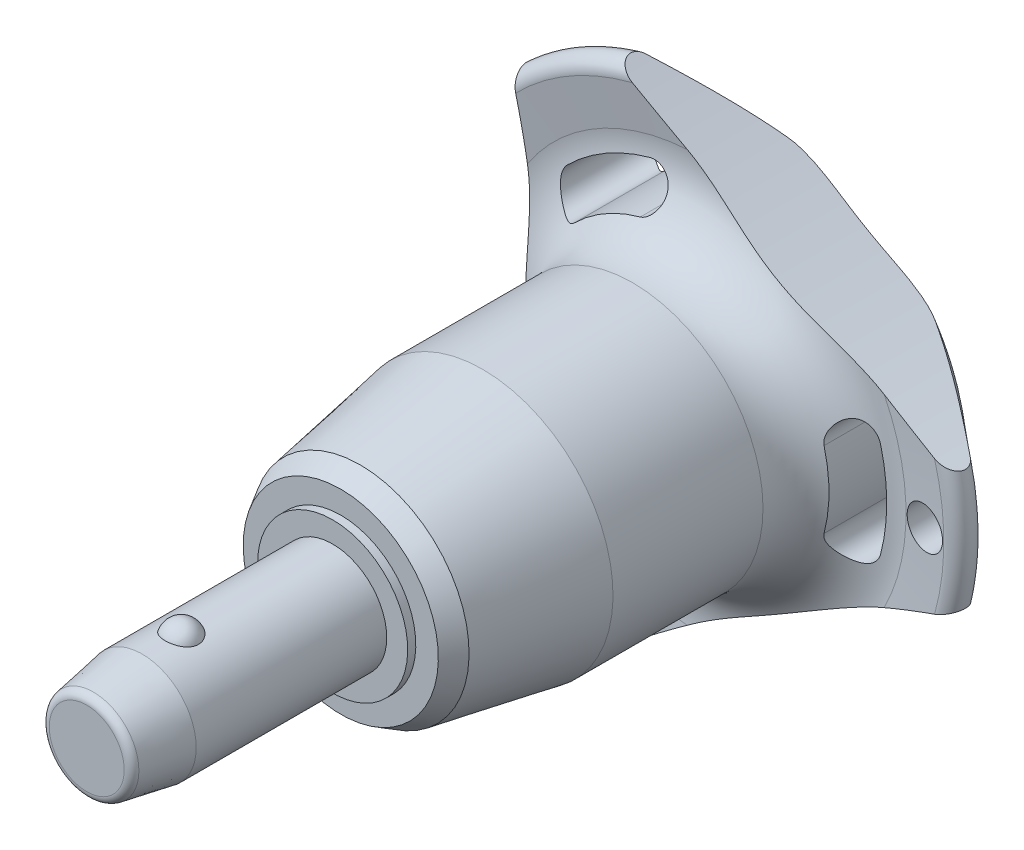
from build123d import *

# Parameters (mm, degrees)
SKETCH1_R           = 4
BOSS_EXTRUDE1_DEPTH = 10
SKETCH2_R           = 3.4
BOSS_EXTRUDE2_DEPTH = 33.3
BOSS_EXTRUDE3_START = 8.2
SKETCH1_2_R         = 4
BOSS_EXTRUDE3_DEPTH = 8.2
CHAMFER1_SIZE       = 4.1
CHAMFER1_SIZE2      = 0.722940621
FILLET1_R           = 0.6
SKETCH6_R           = 102.8
CUT_EXTRUDE1_DEPTH  = 52.415192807
CIRPATTERN1_COUNT   = 3
SKETCH7_R           = 1.5
CUT_EXTRUDE2_DEPTH  = 52.099652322


with BuildPart() as part:
    # Sketch1 → Boss-Extrude1 (new body)
    with BuildSketch(Plane.XY):
        Circle(SKETCH1_R)
    extrude(amount=-BOSS_EXTRUDE1_DEPTH)

    # Sketch2 → Boss-Extrude2 (add)
    with BuildSketch(Plane(origin=(0, 0, -10), x_dir=(-1, 0, 0), z_dir=(0, 0, -1))):
        Circle(SKETCH2_R)
    extrude(amount=BOSS_EXTRUDE2_DEPTH)

    # Sketch3 → Revolve1 (revolve)
    with BuildSketch(Plane(origin=(0, 0, 0), x_dir=(0, 0, -1), z_dir=(1, 0, 0))):
        with BuildLine():
            Line((-1.2, 4.8), (-1.2, 2.2))
            ThreePointArc((-1.2, 2.2), (0.1, 3.5), (-1.2, 4.8))
        make_face()
        with BuildLine():
            Line((-1.2, -2.2), (-1.2, -4.8))
            ThreePointArc((-1.2, -4.8), (0.1, -3.5), (-1.2, -2.2))
        make_face()
    revolve(axis=Axis((0, -2.2, 1.2), (0, 1, 0)))

    # Sketch1_2 → Boss-Extrude3 (add)
    with BuildSketch(Plane.XY.offset(BOSS_EXTRUDE3_START)):
        Circle(SKETCH1_2_R)
    extrude(amount=-BOSS_EXTRUDE3_DEPTH)

    # Chamfer1
    chamfer1_edges = [part.edges().sort_by_distance(p)[0] for p in [
        (-4, 0, 8.2),
    ]]
    chamfer1_side = [part.faces().sort_by_distance(p)[0] for p in [
        (-4, 0, -0.9),
    ]]
    chamfer(chamfer1_edges, length=CHAMFER1_SIZE, length2=CHAMFER1_SIZE2, reference=chamfer1_side[0])

    # Fillet1
    fillet1_edges = [part.edges().sort_by_distance(p)[0] for p in [
        (-3.277059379, 0, 8.2),
        (3.4, 0, -43.3),
    ]]
    fillet(fillet1_edges, radius=FILLET1_R)

    # Sketch4 → Revolve2 (revolve)
    with BuildSketch(Plane(origin=(0, 0, 0), x_dir=(0, 0, -1), z_dir=(1, 0, 0))):
        Polygon((10, 0), (10, 5.554101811), (10.6, 5.554101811), (10.6, 7.220004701), (12.042714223, 8.052956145), (21.1, 9.65), (32.2, 9.65), (32.2, 0), align=None)
    revolve(axis=Axis((0, 0, -32.2), (0, 0, 1)))

    # Sketch5 → Revolve3 (revolve)
    with BuildSketch(Plane(origin=(0, 0, 0), x_dir=(0, 0, -1), z_dir=(1, 0, 0)), mode=Mode.PRIVATE) as revolve3_sk:
        with BuildLine():
            Line((37.16082631, 15.274661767), (36.757834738, 18.475067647))
            ThreePointArc((36.757834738, 18.475067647), (37.349836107, 19.516443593), (38.516044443, 19.24278761))
            Line((38.516044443, 19.24278761), (42.835691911, 14.094832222))
            ThreePointArc((42.835691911, 14.094832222), (43.3, 12.689260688), (42.67067517, 11.349423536))
            ThreePointArc((42.67067517, 11.349423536), (39.033110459, 6.185112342), (37.75, 0))
            Line((37.75, 0), (32.2, 0))
            Line((32.2, 0), (32.2, 9.65))
            ThreePointArc((32.2, 9.65), (35.949887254, 11.342683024), (37.16082631, 15.274661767))
        make_face()
    revolve(revolve3_sk.sketch.rotate(Axis((0, 0, -37.75), (0, 0, 1)), 90), axis=Axis((0, 0, -37.75), (0, 0, 1)))

    # Sketch6 → Cut-Extrude1 (cut, through all)
    with BuildSketch(Plane.XY):
        with Locations((-115.2, 0)):
            Circle(SKETCH6_R)
        with BuildLine():
            ThreePointArc((13.411913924, -3.529271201), (13.868496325, 0), (13.411913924, 3.529271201))
            ThreePointArc((13.411913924, 3.529271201), (11.694200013, 4.531299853), (10.692171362, 2.813585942))
            ThreePointArc((10.692171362, 2.813585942), (11.056165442, 0), (10.692171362, -2.813585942))
            ThreePointArc((10.692171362, -2.813585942), (11.694200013, -4.531299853), (13.411913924, -3.529271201))
        make_face()
    cut_extrude1 = extrude(amount=-CUT_EXTRUDE1_DEPTH, mode=Mode.SUBTRACT)

    # CirPattern1: Cut-Extrude1 ×3 about axis
    cirpattern1_axis = Axis((0, 0, 0), (0, 0, 1))
    for i in range(1, CIRPATTERN1_COUNT):
        add(cut_extrude1.rotate(cirpattern1_axis, i * 360 / CIRPATTERN1_COUNT), mode=Mode.SUBTRACT)

    # Sketch7 → Cut-Extrude2 (cut, through all)
    with BuildSketch(Plane.XY):
        with Locations(Location((16.868496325, 0, 0), (0, 0, 225.467095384))):
            Circle(SKETCH7_R)
    extrude(amount=-CUT_EXTRUDE2_DEPTH, mode=Mode.SUBTRACT)


solid = part.part
